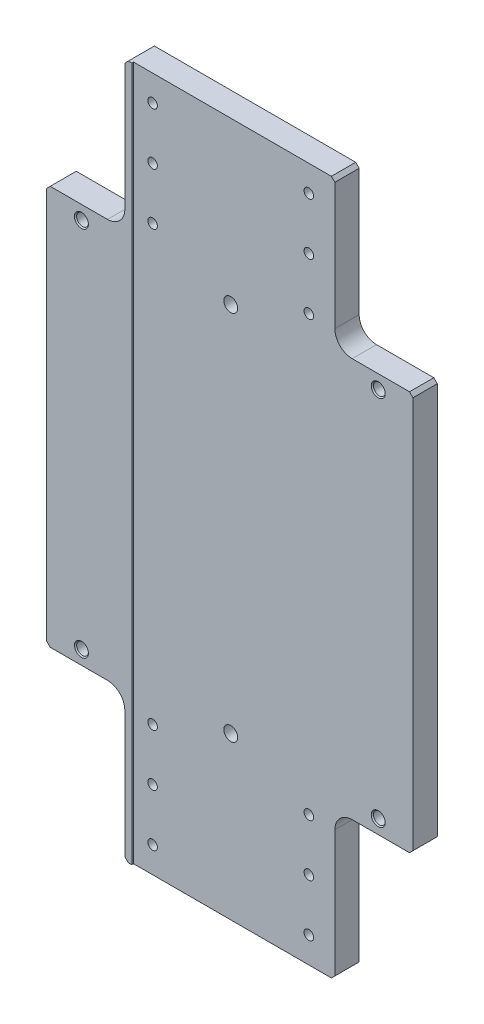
from build123d import *

# Parameters (mm, degrees)
EXTRUDE_1_DEPTH              = 7.5
SKETCH_2_W                   = 161
SKETCH_2_H                   = 400
CUT_EXTRUDE_1_DEPTH          = 1
HOLE_WIZARD_M8_1_AT_2_COUNT  = 2
HOLE_WIZARD_M8_1_AT_2_PITCH  = 214
HOLE_WIZARD_M8_2_AT_2_COUNT  = 2
HOLE_WIZARD_M8_2_AT_2_PITCH  = 214
F_8_0MM_1_D                  = 8
HOLE_WIZARD_M5_1_D           = 5.5
HOLE_WIZARD_M5_1_CBORE_D     = 9.5
HOLE_WIZARD_M5_1_CBORE_DEPTH = 7
PATTERN_LINEAR_1_COUNT       = 2
PATTERN_LINEAR_1_PITCH       = 310
FILLET_1_R                   = 10
CHAMFER_1_SIZE               = 2


with BuildPart() as part:
    # Sketch 1 → Extrude 1 (new, symmetric)
    with BuildSketch(Plane.XY):
        Polygon((60, 115), (105, 115), (105, -115), (60, -115), (60, -200), (-60, -200), (-60, -115), (-105, -115), (-105, 115), (-60, 115), (-60, 200), (60, 200), align=None)
    extrude(amount=EXTRUDE_1_DEPTH, both=True)

    # Sketch 2 → Cut-Extrude 1 (cut)
    with BuildSketch(Plane.XY.offset(7.5)):
        with Locations((24.5, 0)):
            Rectangle(SKETCH_2_W, SKETCH_2_H)
    extrude(amount=-CUT_EXTRUDE_1_DEPTH, mode=Mode.SUBTRACT)

    # Sketch 4 → Hole Wizard M8 _ _1 (revolve, cut)
    with BuildSketch(Plane(origin=(-85, 107, 7.5), x_dir=(0, -1, 0), z_dir=(1, 0, 0))):
        Polygon((0, 0), (0, 15), (4.025, 15), (3.4, 14.375), (3.4, 0.625), (4.025, 0), align=None)
    hole_wizard_m8_1 = revolve(axis=Axis((-85, 107, 13.85), (0, 0, -1)), mode=Mode.SUBTRACT)

    # Hole Wizard M8 _ _1 at 2: Hole Wizard M8 _ _1 ×2
    with Locations(*[(0, -i * HOLE_WIZARD_M8_1_AT_2_PITCH, 0) for i in range(1, HOLE_WIZARD_M8_1_AT_2_COUNT)]):
        add(hole_wizard_m8_1, mode=Mode.SUBTRACT)

    # Sketch 6 → Hole Wizard M8 _ _2 (revolve, cut)
    with BuildSketch(Plane(origin=(85, 107, 6.5), x_dir=(0, -1, 0), z_dir=(1, 0, 0))):
        Polygon((0, 0), (0, 14), (4.025, 14), (3.4, 13.375), (3.4, 0.625), (4.025, 0), align=None)
    hole_wizard_m8_2 = revolve(axis=Axis((85, 107, 12.85), (0, 0, -1)), mode=Mode.SUBTRACT)

    # Hole Wizard M8 _ _2 at 2: Hole Wizard M8 _ _2 ×2
    with Locations(*[(0, -i * HOLE_WIZARD_M8_2_AT_2_PITCH, 0) for i in range(1, HOLE_WIZARD_M8_2_AT_2_COUNT)]):
        add(hole_wizard_m8_2, mode=Mode.SUBTRACT)

    # 8.0mm _ _1 (through all)
    with Locations(Plane.XY.offset(6.5)):
        with Locations((0, -107), (0, 107)):
            Hole(F_8_0MM_1_D / 2)

    # Hole Wizard M5 _ _ _ _ _1 (through all)
    with Locations(Plane(origin=(0, 0, -7.5), x_dir=(-1, 0, 0), z_dir=(0, 0, -1))):
        with Locations((-45, 185), (45, 185), (-45, 155), (45, 155), (-45, 125), (45, 125)):
            hole_wizard_m5_1 = CounterBoreHole(HOLE_WIZARD_M5_1_D / 2, HOLE_WIZARD_M5_1_CBORE_D / 2, HOLE_WIZARD_M5_1_CBORE_DEPTH)

    # Pattern Linear 1: Hole Wizard M5 _ _ _ _ _1 ×2
    with Locations(*[(0, -i * PATTERN_LINEAR_1_PITCH, 0) for i in range(1, PATTERN_LINEAR_1_COUNT)]):
        add(hole_wizard_m5_1, mode=Mode.SUBTRACT)

    # Fillet 1
    fillet_1_edges = [part.edges().sort_by_distance(p)[0] for p in [
        (-60, -115, 0),
        (-60, 115, 0),
        (60, 115, -0.5),
        (60, -115, -0.5),
    ]]
    fillet(fillet_1_edges, radius=FILLET_1_R)

    # Chamfer 1
    chamfer_1_edges = [part.edges().sort_by_distance(p)[0] for p in [
        (-60, -200, 0),
        (-105, -115, 0),
        (-105, 115, 0),
        (-60, 200, 0),
        (60, -200, -0.5),
        (60, 200, -0.5),
        (105, 115, -0.5),
        (105, -115, -0.5),
    ]]
    chamfer(chamfer_1_edges, length=CHAMFER_1_SIZE)


solid = part.part
